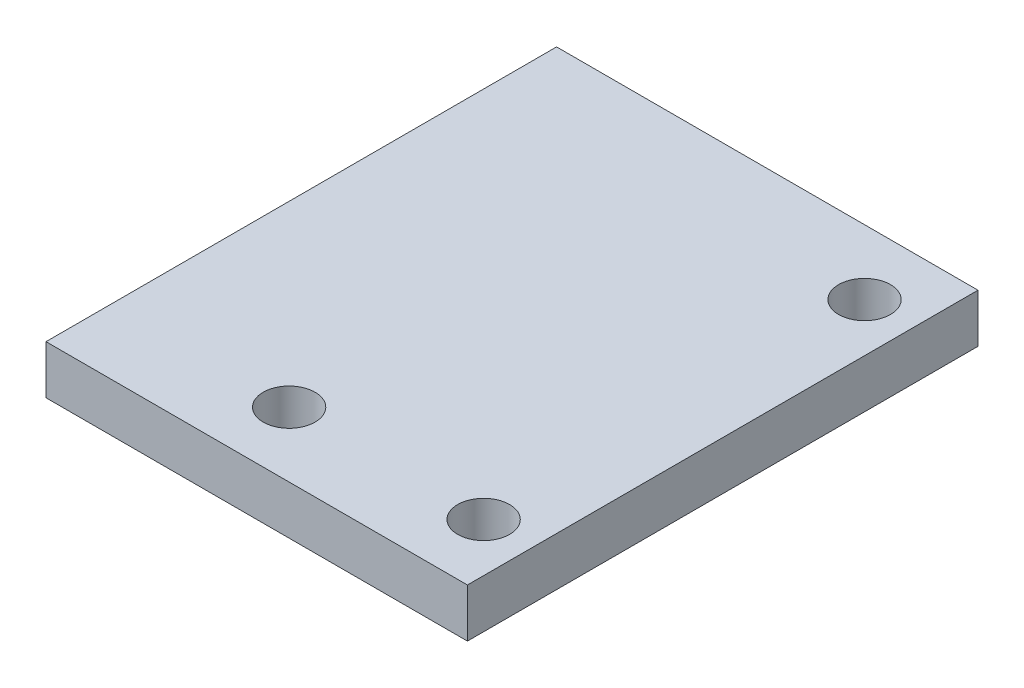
ISO-10303-21;
HEADER;
FILE_DESCRIPTION(('STEP AP214'),'2;1');
FILE_NAME('part.step','',(''),(''),'','','');
FILE_SCHEMA(('AUTOMOTIVE_DESIGN { 1 0 10303 214 1 1 1 1 }'));
ENDSEC;
DATA;
#1=APPLICATION_CONTEXT('core data for automotive mechanical design processes');
#2=APPLICATION_PROTOCOL_DEFINITION('international standard','automotive_design',2000,#1);
#3=PRODUCT_CONTEXT('',#1,'mechanical');
#4=PRODUCT('Part','Part','',(#3));
#5=PRODUCT_RELATED_PRODUCT_CATEGORY('part','',(#4));
#6=PRODUCT_DEFINITION_FORMATION('','',#4);
#7=PRODUCT_DEFINITION_CONTEXT('part definition',#1,'design');
#8=PRODUCT_DEFINITION('design','',#6,#7);
#9=PRODUCT_DEFINITION_SHAPE('','',#8);
#10=(LENGTH_UNIT() NAMED_UNIT(*) SI_UNIT(.MILLI.,.METRE.));
#11=(NAMED_UNIT(*) PLANE_ANGLE_UNIT() SI_UNIT($,.RADIAN.));
#12=(NAMED_UNIT(*) SI_UNIT($,.STERADIAN.) SOLID_ANGLE_UNIT());
#13=UNCERTAINTY_MEASURE_WITH_UNIT(LENGTH_MEASURE(1.E-05),#10,'distance_accuracy_value','');
#14=(GEOMETRIC_REPRESENTATION_CONTEXT(3) GLOBAL_UNCERTAINTY_ASSIGNED_CONTEXT((#13)) GLOBAL_UNIT_ASSIGNED_CONTEXT((#10,
#11,#12)) REPRESENTATION_CONTEXT('',''));
#15=CARTESIAN_POINT('',(0.,0.,0.));
#16=DIRECTION('',(0.,0.,1.));
#17=DIRECTION('',(1.,0.,0.));
#18=AXIS2_PLACEMENT_3D('',#15,#16,#17);
#19=CARTESIAN_POINT('',(-23.,3.,0.));
#20=DIRECTION('',(-1.,0.,0.));
#21=DIRECTION('',(0.,0.,1.));
#22=AXIS2_PLACEMENT_3D('',#19,#20,#21);
#23=PLANE('',#22);
#24=DIRECTION('',(0.,0.,-1.));
#25=VECTOR('',#24,1.);
#26=CARTESIAN_POINT('',(-23.,0.,0.));
#27=LINE('',#26,#25);
#28=CARTESIAN_POINT('',(-23.,0.,15.4025240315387));
#29=VERTEX_POINT('',#28);
#30=CARTESIAN_POINT('',(-23.,0.,-16.0974759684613));
#31=VERTEX_POINT('',#30);
#32=EDGE_CURVE('E118',#29,#31,#27,.T.);
#33=ORIENTED_EDGE('',*,*,#32,.F.);
#34=DIRECTION('',(0.,-1.,0.));
#35=VECTOR('',#34,1.);
#36=CARTESIAN_POINT('',(-23.,3.,15.4025240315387));
#37=LINE('',#36,#35);
#38=CARTESIAN_POINT('',(-23.,3.,15.4025240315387));
#39=VERTEX_POINT('',#38);
#40=EDGE_CURVE('E11',#39,#29,#37,.T.);
#41=ORIENTED_EDGE('',*,*,#40,.F.);
#42=DIRECTION('',(0.,0.,-1.));
#43=VECTOR('',#42,1.);
#44=CARTESIAN_POINT('',(-23.,3.,0.));
#45=LINE('',#44,#43);
#46=CARTESIAN_POINT('',(-23.,3.,-16.0974759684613));
#47=VERTEX_POINT('',#46);
#48=EDGE_CURVE('E102',#39,#47,#45,.T.);
#49=ORIENTED_EDGE('',*,*,#48,.T.);
#50=DIRECTION('',(0.,-1.,0.));
#51=VECTOR('',#50,1.);
#52=CARTESIAN_POINT('',(-23.,3.,-16.0974759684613));
#53=LINE('',#52,#51);
#54=EDGE_CURVE('E81',#47,#31,#53,.T.);
#55=ORIENTED_EDGE('',*,*,#54,.T.);
#56=EDGE_LOOP('',(#33,#41,#49,#55));
#57=FACE_BOUND('',#56,.T.);
#58=ADVANCED_FACE('F41',(#57),#23,.T.);
#59=CARTESIAN_POINT('',(0.,3.,15.4025240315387));
#60=DIRECTION('',(0.,0.,1.));
#61=DIRECTION('',(1.,0.,0.));
#62=AXIS2_PLACEMENT_3D('',#59,#60,#61);
#63=PLANE('',#62);
#64=DIRECTION('',(-1.,0.,0.));
#65=VECTOR('',#64,1.);
#66=CARTESIAN_POINT('',(0.,0.,15.4025240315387));
#67=LINE('',#66,#65);
#68=CARTESIAN_POINT('',(3.,0.,15.4025240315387));
#69=VERTEX_POINT('',#68);
#70=EDGE_CURVE('E93',#69,#29,#67,.T.);
#71=ORIENTED_EDGE('',*,*,#70,.F.);
#72=DIRECTION('',(0.,-1.,0.));
#73=VECTOR('',#72,1.);
#74=CARTESIAN_POINT('',(3.,3.,15.4025240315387));
#75=LINE('',#74,#73);
#76=CARTESIAN_POINT('',(3.,3.,15.4025240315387));
#77=VERTEX_POINT('',#76);
#78=EDGE_CURVE('E50',#77,#69,#75,.T.);
#79=ORIENTED_EDGE('',*,*,#78,.F.);
#80=DIRECTION('',(-1.,0.,0.));
#81=VECTOR('',#80,1.);
#82=CARTESIAN_POINT('',(0.,3.,15.4025240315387));
#83=LINE('',#82,#81);
#84=EDGE_CURVE('E91',#77,#39,#83,.T.);
#85=ORIENTED_EDGE('',*,*,#84,.T.);
#86=ORIENTED_EDGE('',*,*,#40,.T.);
#87=EDGE_LOOP('',(#71,#79,#85,#86));
#88=FACE_BOUND('',#87,.T.);
#89=ADVANCED_FACE('F89',(#88),#63,.T.);
#90=CARTESIAN_POINT('',(3.,3.,0.));
#91=DIRECTION('',(-1.,0.,0.));
#92=DIRECTION('',(0.,0.,1.));
#93=AXIS2_PLACEMENT_3D('',#90,#91,#92);
#94=PLANE('',#93);
#95=DIRECTION('',(0.,0.,-1.));
#96=VECTOR('',#95,1.);
#97=CARTESIAN_POINT('',(3.,0.,0.));
#98=LINE('',#97,#96);
#99=CARTESIAN_POINT('',(3.,0.,-16.0974759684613));
#100=VERTEX_POINT('',#99);
#101=EDGE_CURVE('E121',#69,#100,#98,.T.);
#102=ORIENTED_EDGE('',*,*,#101,.T.);
#103=DIRECTION('',(0.,-1.,0.));
#104=VECTOR('',#103,1.);
#105=CARTESIAN_POINT('',(3.,3.,-16.0974759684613));
#106=LINE('',#105,#104);
#107=CARTESIAN_POINT('',(3.,3.,-16.0974759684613));
#108=VERTEX_POINT('',#107);
#109=EDGE_CURVE('E96',#108,#100,#106,.T.);
#110=ORIENTED_EDGE('',*,*,#109,.F.);
#111=DIRECTION('',(0.,0.,-1.));
#112=VECTOR('',#111,1.);
#113=CARTESIAN_POINT('',(3.,3.,0.));
#114=LINE('',#113,#112);
#115=EDGE_CURVE('E98',#77,#108,#114,.T.);
#116=ORIENTED_EDGE('',*,*,#115,.F.);
#117=ORIENTED_EDGE('',*,*,#78,.T.);
#118=EDGE_LOOP('',(#102,#110,#116,#117));
#119=FACE_BOUND('',#118,.T.);
#120=ADVANCED_FACE('F99',(#119),#94,.F.);
#121=CARTESIAN_POINT('',(0.,3.,-12.0974759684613));
#122=DIRECTION('',(0.,-1.,0.));
#123=DIRECTION('',(0.,0.,-1.));
#124=AXIS2_PLACEMENT_3D('',#121,#122,#123);
#125=CYLINDRICAL_SURFACE('',#124,1.6);
#126=CARTESIAN_POINT('',(0.,3.,-12.0974759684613));
#127=DIRECTION('',(0.,1.,0.));
#128=DIRECTION('',(0.,0.,1.));
#129=AXIS2_PLACEMENT_3D('',#126,#127,#128);
#130=CIRCLE('',#129,1.6);
#131=CARTESIAN_POINT('',(0.,3.,-10.4974759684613));
#132=VERTEX_POINT('',#131);
#133=EDGE_CURVE('E104',#132,#132,#130,.T.);
#134=ORIENTED_EDGE('',*,*,#133,.T.);
#135=EDGE_LOOP('',(#134));
#136=FACE_BOUND('',#135,.T.);
#137=CARTESIAN_POINT('',(0.,0.,-12.0974759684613));
#138=DIRECTION('',(0.,1.,0.));
#139=DIRECTION('',(0.,0.,1.));
#140=AXIS2_PLACEMENT_3D('',#137,#138,#139);
#141=CIRCLE('',#140,1.6);
#142=CARTESIAN_POINT('',(0.,0.,-10.4974759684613));
#143=VERTEX_POINT('',#142);
#144=EDGE_CURVE('E115',#143,#143,#141,.T.);
#145=ORIENTED_EDGE('',*,*,#144,.F.);
#146=EDGE_LOOP('',(#145));
#147=FACE_BOUND('',#146,.T.);
#148=ADVANCED_FACE('F137',(#136,#147),#125,.F.);
#149=CARTESIAN_POINT('',(0.,3.,11.4025240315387));
#150=DIRECTION('',(0.,-1.,0.));
#151=DIRECTION('',(0.,0.,-1.));
#152=AXIS2_PLACEMENT_3D('',#149,#150,#151);
#153=CYLINDRICAL_SURFACE('',#152,1.6);
#154=CARTESIAN_POINT('',(0.,3.,11.4025240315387));
#155=DIRECTION('',(0.,1.,0.));
#156=DIRECTION('',(0.,0.,1.));
#157=AXIS2_PLACEMENT_3D('',#154,#155,#156);
#158=CIRCLE('',#157,1.6);
#159=CARTESIAN_POINT('',(0.,3.,13.0025240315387));
#160=VERTEX_POINT('',#159);
#161=EDGE_CURVE('E150',#160,#160,#158,.T.);
#162=ORIENTED_EDGE('',*,*,#161,.T.);
#163=EDGE_LOOP('',(#162));
#164=FACE_BOUND('',#163,.T.);
#165=CARTESIAN_POINT('',(0.,0.,11.4025240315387));
#166=DIRECTION('',(0.,1.,0.));
#167=DIRECTION('',(0.,0.,1.));
#168=AXIS2_PLACEMENT_3D('',#165,#166,#167);
#169=CIRCLE('',#168,1.6);
#170=CARTESIAN_POINT('',(0.,0.,13.0025240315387));
#171=VERTEX_POINT('',#170);
#172=EDGE_CURVE('E112',#171,#171,#169,.T.);
#173=ORIENTED_EDGE('',*,*,#172,.F.);
#174=EDGE_LOOP('',(#173));
#175=FACE_BOUND('',#174,.T.);
#176=ADVANCED_FACE('F139',(#164,#175),#153,.F.);
#177=CARTESIAN_POINT('',(-12.,3.,11.4025240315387));
#178=DIRECTION('',(0.,-1.,0.));
#179=DIRECTION('',(0.,0.,-1.));
#180=AXIS2_PLACEMENT_3D('',#177,#178,#179);
#181=CYLINDRICAL_SURFACE('',#180,1.6);
#182=CARTESIAN_POINT('',(-12.,3.,11.4025240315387));
#183=DIRECTION('',(0.,1.,0.));
#184=DIRECTION('',(0.,0.,1.));
#185=AXIS2_PLACEMENT_3D('',#182,#183,#184);
#186=CIRCLE('',#185,1.6);
#187=CARTESIAN_POINT('',(-12.,3.,13.0025240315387));
#188=VERTEX_POINT('',#187);
#189=EDGE_CURVE('E124',#188,#188,#186,.T.);
#190=ORIENTED_EDGE('',*,*,#189,.T.);
#191=EDGE_LOOP('',(#190));
#192=FACE_BOUND('',#191,.T.);
#193=CARTESIAN_POINT('',(-12.,0.,11.4025240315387));
#194=DIRECTION('',(0.,1.,0.));
#195=DIRECTION('',(0.,0.,1.));
#196=AXIS2_PLACEMENT_3D('',#193,#194,#195);
#197=CIRCLE('',#196,1.6);
#198=CARTESIAN_POINT('',(-12.,0.,13.0025240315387));
#199=VERTEX_POINT('',#198);
#200=EDGE_CURVE('E109',#199,#199,#197,.T.);
#201=ORIENTED_EDGE('',*,*,#200,.F.);
#202=EDGE_LOOP('',(#201));
#203=FACE_BOUND('',#202,.T.);
#204=ADVANCED_FACE('F43',(#192,#203),#181,.F.);
#205=CARTESIAN_POINT('',(0.,3.,-16.0974759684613));
#206=DIRECTION('',(0.,0.,1.));
#207=DIRECTION('',(1.,0.,0.));
#208=AXIS2_PLACEMENT_3D('',#205,#206,#207);
#209=PLANE('',#208);
#210=DIRECTION('',(-1.,0.,0.));
#211=VECTOR('',#210,1.);
#212=CARTESIAN_POINT('',(0.,0.,-16.0974759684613));
#213=LINE('',#212,#211);
#214=EDGE_CURVE('E74',#100,#31,#213,.T.);
#215=ORIENTED_EDGE('',*,*,#214,.T.);
#216=ORIENTED_EDGE('',*,*,#54,.F.);
#217=DIRECTION('',(-1.,0.,0.));
#218=VECTOR('',#217,1.);
#219=CARTESIAN_POINT('',(0.,3.,-16.0974759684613));
#220=LINE('',#219,#218);
#221=EDGE_CURVE('E58',#108,#47,#220,.T.);
#222=ORIENTED_EDGE('',*,*,#221,.F.);
#223=ORIENTED_EDGE('',*,*,#109,.T.);
#224=EDGE_LOOP('',(#215,#216,#222,#223));
#225=FACE_BOUND('',#224,.T.);
#226=ADVANCED_FACE('F127',(#225),#209,.F.);
#227=CARTESIAN_POINT('',(0.,3.,0.));
#228=DIRECTION('',(0.,1.,0.));
#229=DIRECTION('',(0.,0.,1.));
#230=AXIS2_PLACEMENT_3D('',#227,#228,#229);
#231=PLANE('',#230);
#232=ORIENTED_EDGE('',*,*,#189,.F.);
#233=EDGE_LOOP('',(#232));
#234=FACE_BOUND('',#233,.T.);
#235=ORIENTED_EDGE('',*,*,#161,.F.);
#236=EDGE_LOOP('',(#235));
#237=FACE_BOUND('',#236,.T.);
#238=ORIENTED_EDGE('',*,*,#133,.F.);
#239=EDGE_LOOP('',(#238));
#240=FACE_BOUND('',#239,.T.);
#241=ORIENTED_EDGE('',*,*,#48,.F.);
#242=ORIENTED_EDGE('',*,*,#84,.F.);
#243=ORIENTED_EDGE('',*,*,#115,.T.);
#244=ORIENTED_EDGE('',*,*,#221,.T.);
#245=EDGE_LOOP('',(#241,#242,#243,#244));
#246=FACE_BOUND('',#245,.T.);
#247=ADVANCED_FACE('F101',(#234,#237,#240,#246),#231,.T.);
#248=CARTESIAN_POINT('',(0.,0.,0.));
#249=DIRECTION('',(0.,1.,0.));
#250=DIRECTION('',(0.,0.,1.));
#251=AXIS2_PLACEMENT_3D('',#248,#249,#250);
#252=PLANE('',#251);
#253=ORIENTED_EDGE('',*,*,#200,.T.);
#254=EDGE_LOOP('',(#253));
#255=FACE_BOUND('',#254,.T.);
#256=ORIENTED_EDGE('',*,*,#172,.T.);
#257=EDGE_LOOP('',(#256));
#258=FACE_BOUND('',#257,.T.);
#259=ORIENTED_EDGE('',*,*,#144,.T.);
#260=EDGE_LOOP('',(#259));
#261=FACE_BOUND('',#260,.T.);
#262=ORIENTED_EDGE('',*,*,#32,.T.);
#263=ORIENTED_EDGE('',*,*,#214,.F.);
#264=ORIENTED_EDGE('',*,*,#101,.F.);
#265=ORIENTED_EDGE('',*,*,#70,.T.);
#266=EDGE_LOOP('',(#262,#263,#264,#265));
#267=FACE_BOUND('',#266,.T.);
#268=ADVANCED_FACE('F128',(#255,#258,#261,#267),#252,.F.);
#269=CLOSED_SHELL('',(#58,#89,#120,#148,#176,#204,#226,#247,#268));
#270=MANIFOLD_SOLID_BREP('B2',#269);
#271=ADVANCED_BREP_SHAPE_REPRESENTATION('',(#18,#270),#14);
#272=SHAPE_DEFINITION_REPRESENTATION(#9,#271);
ENDSEC;
END-ISO-10303-21;
